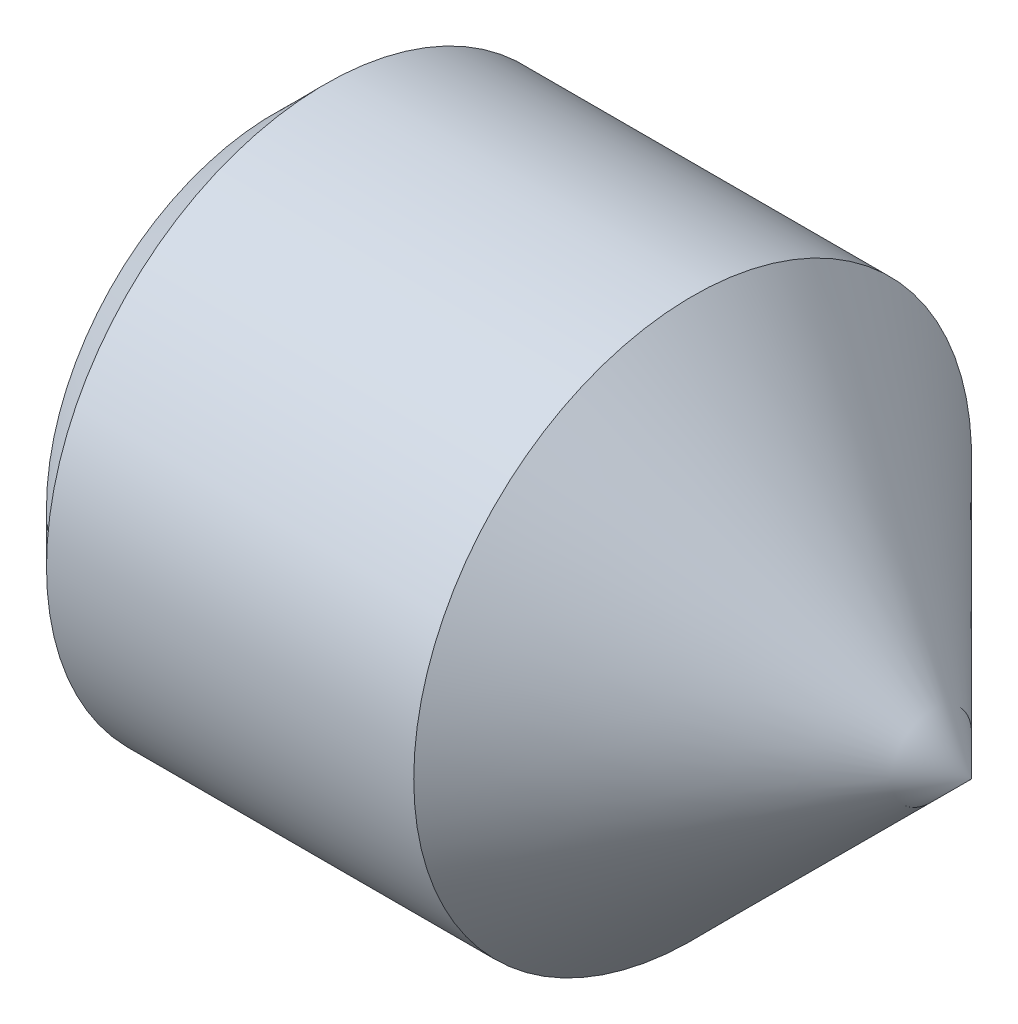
from build123d import *

# Parameters (mm, degrees)
HEX_2_DEPTH = 6.35


with BuildPart() as part:
    # BodySke → BaseBody (revolve)
    with BuildSketch(Plane.XY, mode=Mode.PRIVATE) as basebody_sk:
        Polygon((0, 0), (0, 5.18668), (1.16332, 6.35), (9.525, 6.35), (15.875, 0), align=None)
    revolve(basebody_sk.sketch.rotate(Axis((-12.7, 0, 0), (1, 0, 0)), 90), axis=Axis((-12.7, 0, 0), (1, 0, 0)))

    # Sketch2 → Hex 2 (cut)
    with BuildSketch(Plane.ZY):
        Polygon((1.833087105, 3.175), (-1.833087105, 3.175), (-3.666174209, 0), (-1.833087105, -3.175), (1.833087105, -3.175), (3.666174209, 0), align=None)
    extrude(amount=-HEX_2_DEPTH, mode=Mode.SUBTRACT)


solid = part.part
